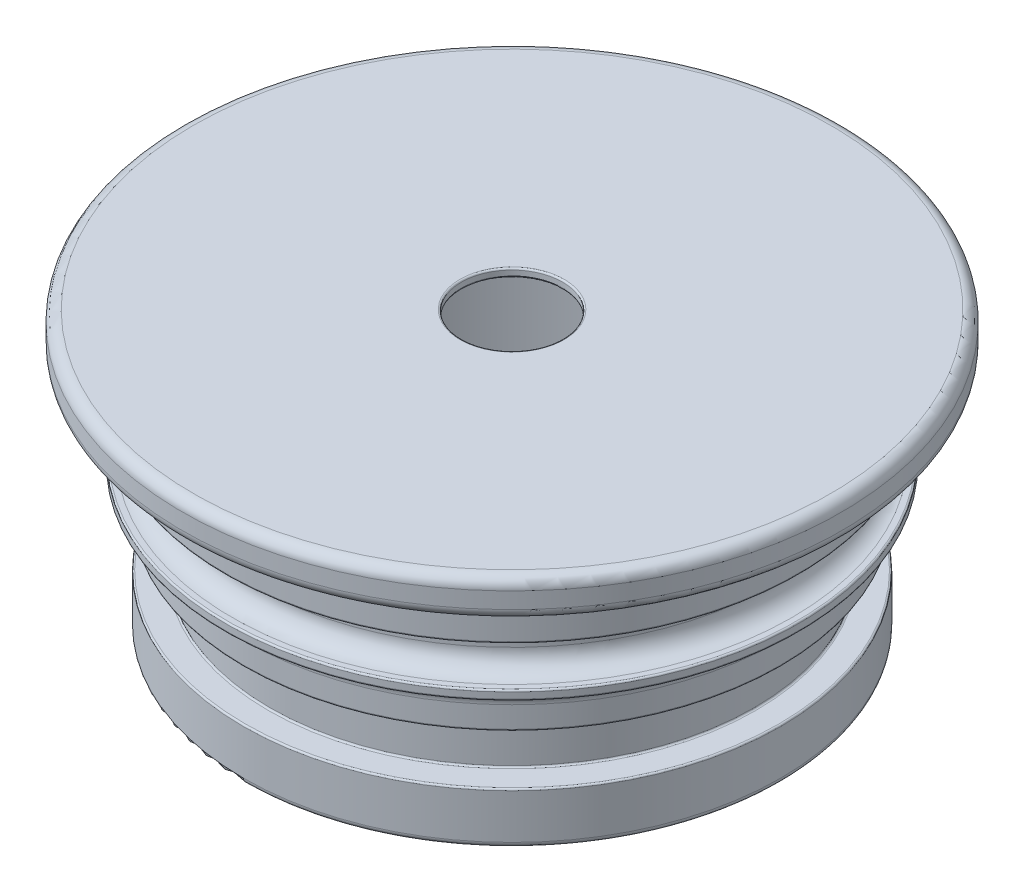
ISO-10303-21;
HEADER;
FILE_DESCRIPTION(('STEP AP214'),'2;1');
FILE_NAME('part.step','',(''),(''),'','','');
FILE_SCHEMA(('AUTOMOTIVE_DESIGN { 1 0 10303 214 1 1 1 1 }'));
ENDSEC;
DATA;
#1=APPLICATION_CONTEXT('core data for automotive mechanical design processes');
#2=APPLICATION_PROTOCOL_DEFINITION('international standard','automotive_design',2000,#1);
#3=PRODUCT_CONTEXT('',#1,'mechanical');
#4=PRODUCT('Part','Part','',(#3));
#5=PRODUCT_RELATED_PRODUCT_CATEGORY('part','',(#4));
#6=PRODUCT_DEFINITION_FORMATION('','',#4);
#7=PRODUCT_DEFINITION_CONTEXT('part definition',#1,'design');
#8=PRODUCT_DEFINITION('design','',#6,#7);
#9=PRODUCT_DEFINITION_SHAPE('','',#8);
#10=(LENGTH_UNIT() NAMED_UNIT(*) SI_UNIT(.MILLI.,.METRE.));
#11=(NAMED_UNIT(*) PLANE_ANGLE_UNIT() SI_UNIT($,.RADIAN.));
#12=(NAMED_UNIT(*) SI_UNIT($,.STERADIAN.) SOLID_ANGLE_UNIT());
#13=UNCERTAINTY_MEASURE_WITH_UNIT(LENGTH_MEASURE(1.E-05),#10,'distance_accuracy_value','');
#14=(GEOMETRIC_REPRESENTATION_CONTEXT(3) GLOBAL_UNCERTAINTY_ASSIGNED_CONTEXT((#13)) GLOBAL_UNIT_ASSIGNED_CONTEXT((#10,
#11,#12)) REPRESENTATION_CONTEXT('',''));
#15=CARTESIAN_POINT('',(0.,0.,0.));
#16=DIRECTION('',(0.,0.,1.));
#17=DIRECTION('',(1.,0.,0.));
#18=AXIS2_PLACEMENT_3D('',#15,#16,#17);
#19=CARTESIAN_POINT('',(0.,-5.1054,0.));
#20=DIRECTION('',(0.,1.,0.));
#21=DIRECTION('',(-1.00000000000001,0.,0.));
#22=AXIS2_PLACEMENT_3D('',#19,#20,#21);
#23=TOROIDAL_SURFACE('',#22,13.208,0.889);
#24=CARTESIAN_POINT('',(0.,-5.9944,0.));
#25=DIRECTION('',(0.,1.,0.));
#26=DIRECTION('',(-1.00000000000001,0.,0.));
#27=AXIS2_PLACEMENT_3D('',#24,#25,#26);
#28=CIRCLE('',#27,13.208);
#29=CARTESIAN_POINT('',(-13.2080000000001,-5.9944,0.));
#30=VERTEX_POINT('',#29);
#31=EDGE_CURVE('E142',#30,#30,#28,.T.);
#32=ORIENTED_EDGE('',*,*,#31,.T.);
#33=EDGE_LOOP('',(#32));
#34=FACE_BOUND('',#33,.T.);
#35=CARTESIAN_POINT('',(0.,-5.1054,0.));
#36=DIRECTION('',(0.,1.,0.));
#37=DIRECTION('',(-1.00000000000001,0.,0.));
#38=AXIS2_PLACEMENT_3D('',#35,#36,#37);
#39=CIRCLE('',#38,12.319);
#40=CARTESIAN_POINT('',(-12.3190000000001,-5.1054,0.));
#41=VERTEX_POINT('',#40);
#42=EDGE_CURVE('E10',#41,#41,#39,.T.);
#43=ORIENTED_EDGE('',*,*,#42,.F.);
#44=EDGE_LOOP('',(#43));
#45=FACE_BOUND('',#44,.T.);
#46=ADVANCED_FACE('F30',(#34,#45),#23,.F.);
#47=CARTESIAN_POINT('',(0.,0.,0.));
#48=DIRECTION('',(0.,1.,0.));
#49=DIRECTION('',(-1.00000000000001,0.,0.));
#50=AXIS2_PLACEMENT_3D('',#47,#48,#49);
#51=CYLINDRICAL_SURFACE('',#50,12.319);
#52=ORIENTED_EDGE('',*,*,#42,.T.);
#53=EDGE_LOOP('',(#52));
#54=FACE_BOUND('',#53,.T.);
#55=CARTESIAN_POINT('',(0.,-4.1656,0.));
#56=DIRECTION('',(0.,1.,0.));
#57=DIRECTION('',(-1.00000000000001,0.,0.));
#58=AXIS2_PLACEMENT_3D('',#55,#56,#57);
#59=CIRCLE('',#58,12.319);
#60=CARTESIAN_POINT('',(-12.3190000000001,-4.16560000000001,0.));
#61=VERTEX_POINT('',#60);
#62=EDGE_CURVE('E36',#61,#61,#59,.T.);
#63=ORIENTED_EDGE('',*,*,#62,.F.);
#64=EDGE_LOOP('',(#63));
#65=FACE_BOUND('',#64,.T.);
#66=ADVANCED_FACE('F160',(#54,#65),#51,.T.);
#67=CARTESIAN_POINT('',(0.,-4.1656,0.));
#68=DIRECTION('',(0.,1.,0.));
#69=DIRECTION('',(-1.00000000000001,0.,0.));
#70=AXIS2_PLACEMENT_3D('',#67,#68,#69);
#71=TOROIDAL_SURFACE('',#70,12.3952,0.0762000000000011);
#72=ORIENTED_EDGE('',*,*,#62,.T.);
#73=EDGE_LOOP('',(#72));
#74=FACE_BOUND('',#73,.T.);
#75=CARTESIAN_POINT('',(0.,-4.0894,0.));
#76=DIRECTION('',(0.,1.,0.));
#77=DIRECTION('',(-1.00000000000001,0.,0.));
#78=AXIS2_PLACEMENT_3D('',#75,#76,#77);
#79=CIRCLE('',#78,12.3952);
#80=CARTESIAN_POINT('',(-12.3952000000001,-4.0894,0.));
#81=VERTEX_POINT('',#80);
#82=EDGE_CURVE('E40',#81,#81,#79,.T.);
#83=ORIENTED_EDGE('',*,*,#82,.F.);
#84=EDGE_LOOP('',(#83));
#85=FACE_BOUND('',#84,.T.);
#86=ADVANCED_FACE('F164',(#74,#85),#71,.F.);
#87=CARTESIAN_POINT('',(-12.3952000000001,-4.0894,0.));
#88=DIRECTION('',(0.,-1.,0.));
#89=DIRECTION('',(1.00000000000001,0.,0.));
#90=AXIS2_PLACEMENT_3D('',#87,#88,#89);
#91=PLANE('',#90);
#92=ORIENTED_EDGE('',*,*,#82,.T.);
#93=EDGE_LOOP('',(#92));
#94=FACE_BOUND('',#93,.T.);
#95=CARTESIAN_POINT('',(0.,-4.0894,0.));
#96=DIRECTION('',(0.,1.,0.));
#97=DIRECTION('',(-1.00000000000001,0.,0.));
#98=AXIS2_PLACEMENT_3D('',#95,#96,#97);
#99=CIRCLE('',#98,13.462);
#100=CARTESIAN_POINT('',(-13.4620000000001,-4.0894,0.));
#101=VERTEX_POINT('',#100);
#102=EDGE_CURVE('E44',#101,#101,#99,.T.);
#103=ORIENTED_EDGE('',*,*,#102,.F.);
#104=EDGE_LOOP('',(#103));
#105=FACE_BOUND('',#104,.T.);
#106=ADVANCED_FACE('F168',(#94,#105),#91,.T.);
#107=CARTESIAN_POINT('',(0.,-4.0132,0.));
#108=DIRECTION('',(0.,1.,0.));
#109=DIRECTION('',(-1.00000000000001,0.,0.));
#110=AXIS2_PLACEMENT_3D('',#107,#108,#109);
#111=TOROIDAL_SURFACE('',#110,13.462,0.0762000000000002);
#112=ORIENTED_EDGE('',*,*,#102,.T.);
#113=EDGE_LOOP('',(#112));
#114=FACE_BOUND('',#113,.T.);
#115=CARTESIAN_POINT('',(0.,-4.0132,0.));
#116=DIRECTION('',(0.,1.,0.));
#117=DIRECTION('',(-1.00000000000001,0.,0.));
#118=AXIS2_PLACEMENT_3D('',#115,#116,#117);
#119=CIRCLE('',#118,13.5382);
#120=CARTESIAN_POINT('',(-13.5382000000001,-4.0132,0.));
#121=VERTEX_POINT('',#120);
#122=EDGE_CURVE('E49',#121,#121,#119,.T.);
#123=ORIENTED_EDGE('',*,*,#122,.F.);
#124=EDGE_LOOP('',(#123));
#125=FACE_BOUND('',#124,.T.);
#126=ADVANCED_FACE('F174',(#114,#125),#111,.T.);
#127=CARTESIAN_POINT('',(0.,0.,0.));
#128=DIRECTION('',(0.,1.,0.));
#129=DIRECTION('',(-1.00000000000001,0.,0.));
#130=AXIS2_PLACEMENT_3D('',#127,#128,#129);
#131=CYLINDRICAL_SURFACE('',#130,13.5382);
#132=ORIENTED_EDGE('',*,*,#122,.T.);
#133=EDGE_LOOP('',(#132));
#134=FACE_BOUND('',#133,.T.);
#135=CARTESIAN_POINT('',(0.,-1.8542,0.));
#136=DIRECTION('',(0.,1.,0.));
#137=DIRECTION('',(-1.00000000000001,0.,0.));
#138=AXIS2_PLACEMENT_3D('',#135,#136,#137);
#139=CIRCLE('',#138,13.5382);
#140=CARTESIAN_POINT('',(-13.5382000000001,-1.8542,0.));
#141=VERTEX_POINT('',#140);
#142=EDGE_CURVE('E52',#141,#141,#139,.T.);
#143=ORIENTED_EDGE('',*,*,#142,.F.);
#144=EDGE_LOOP('',(#143));
#145=FACE_BOUND('',#144,.T.);
#146=ADVANCED_FACE('F178',(#134,#145),#131,.T.);
#147=CARTESIAN_POINT('',(0.,-1.8542,0.));
#148=DIRECTION('',(0.,1.,0.));
#149=DIRECTION('',(-1.00000000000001,0.,0.));
#150=AXIS2_PLACEMENT_3D('',#147,#148,#149);
#151=TOROIDAL_SURFACE('',#150,13.6144,0.0762000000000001);
#152=ORIENTED_EDGE('',*,*,#142,.T.);
#153=EDGE_LOOP('',(#152));
#154=FACE_BOUND('',#153,.T.);
#155=CARTESIAN_POINT('',(0.,-1.778,0.));
#156=DIRECTION('',(0.,1.,0.));
#157=DIRECTION('',(-1.00000000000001,0.,0.));
#158=AXIS2_PLACEMENT_3D('',#155,#156,#157);
#159=CIRCLE('',#158,13.6144);
#160=CARTESIAN_POINT('',(-13.6144000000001,-1.778,0.));
#161=VERTEX_POINT('',#160);
#162=EDGE_CURVE('E55',#161,#161,#159,.T.);
#163=ORIENTED_EDGE('',*,*,#162,.F.);
#164=EDGE_LOOP('',(#163));
#165=FACE_BOUND('',#164,.T.);
#166=ADVANCED_FACE('F182',(#154,#165),#151,.F.);
#167=CARTESIAN_POINT('',(-15.0495000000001,-1.778,0.));
#168=DIRECTION('',(0.,-1.,0.));
#169=DIRECTION('',(1.00000000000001,0.,0.));
#170=AXIS2_PLACEMENT_3D('',#167,#168,#169);
#171=PLANE('',#170);
#172=ORIENTED_EDGE('',*,*,#162,.T.);
#173=EDGE_LOOP('',(#172));
#174=FACE_BOUND('',#173,.T.);
#175=CARTESIAN_POINT('',(0.,-1.778,0.));
#176=DIRECTION('',(0.,1.,0.));
#177=DIRECTION('',(-1.00000000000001,0.,0.));
#178=AXIS2_PLACEMENT_3D('',#175,#176,#177);
#179=CIRCLE('',#178,15.0495);
#180=CARTESIAN_POINT('',(-15.0495000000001,-1.778,0.));
#181=VERTEX_POINT('',#180);
#182=EDGE_CURVE('E58',#181,#181,#179,.T.);
#183=ORIENTED_EDGE('',*,*,#182,.F.);
#184=EDGE_LOOP('',(#183));
#185=FACE_BOUND('',#184,.T.);
#186=ADVANCED_FACE('F186',(#174,#185),#171,.T.);
#187=CARTESIAN_POINT('',(0.,-1.27,0.));
#188=DIRECTION('',(0.,1.,0.));
#189=DIRECTION('',(-1.00000000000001,0.,0.));
#190=AXIS2_PLACEMENT_3D('',#187,#188,#189);
#191=TOROIDAL_SURFACE('',#190,15.0495,0.507999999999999);
#192=ORIENTED_EDGE('',*,*,#182,.T.);
#193=EDGE_LOOP('',(#192));
#194=FACE_BOUND('',#193,.T.);
#195=CARTESIAN_POINT('',(0.,-1.27,0.));
#196=DIRECTION('',(0.,1.,0.));
#197=DIRECTION('',(-1.00000000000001,0.,0.));
#198=AXIS2_PLACEMENT_3D('',#195,#196,#197);
#199=CIRCLE('',#198,15.5575);
#200=CARTESIAN_POINT('',(-15.5575000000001,-1.27,0.));
#201=VERTEX_POINT('',#200);
#202=EDGE_CURVE('E61',#201,#201,#199,.T.);
#203=ORIENTED_EDGE('',*,*,#202,.F.);
#204=EDGE_LOOP('',(#203));
#205=FACE_BOUND('',#204,.T.);
#206=ADVANCED_FACE('F190',(#194,#205),#191,.T.);
#207=CARTESIAN_POINT('',(0.,0.,0.));
#208=DIRECTION('',(0.,1.,0.));
#209=DIRECTION('',(-1.00000000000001,0.,0.));
#210=AXIS2_PLACEMENT_3D('',#207,#208,#209);
#211=CYLINDRICAL_SURFACE('',#210,15.5575);
#212=ORIENTED_EDGE('',*,*,#202,.T.);
#213=EDGE_LOOP('',(#212));
#214=FACE_BOUND('',#213,.T.);
#215=CARTESIAN_POINT('',(0.,-0.507999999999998,0.));
#216=DIRECTION('',(0.,1.,0.));
#217=DIRECTION('',(-1.00000000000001,0.,0.));
#218=AXIS2_PLACEMENT_3D('',#215,#216,#217);
#219=CIRCLE('',#218,15.5575);
#220=CARTESIAN_POINT('',(-15.5575000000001,-0.508,0.));
#221=VERTEX_POINT('',#220);
#222=EDGE_CURVE('E64',#221,#221,#219,.T.);
#223=ORIENTED_EDGE('',*,*,#222,.F.);
#224=EDGE_LOOP('',(#223));
#225=FACE_BOUND('',#224,.T.);
#226=ADVANCED_FACE('F194',(#214,#225),#211,.T.);
#227=CARTESIAN_POINT('',(0.,-0.508000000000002,0.));
#228=DIRECTION('',(0.,1.,0.));
#229=DIRECTION('',(-1.00000000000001,0.,0.));
#230=AXIS2_PLACEMENT_3D('',#227,#228,#229);
#231=TOROIDAL_SURFACE('',#230,15.0495,0.508);
#232=ORIENTED_EDGE('',*,*,#222,.T.);
#233=EDGE_LOOP('',(#232));
#234=FACE_BOUND('',#233,.T.);
#235=CARTESIAN_POINT('',(0.,0.,0.));
#236=DIRECTION('',(0.,1.,0.));
#237=DIRECTION('',(-1.00000000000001,0.,0.));
#238=AXIS2_PLACEMENT_3D('',#235,#236,#237);
#239=CIRCLE('',#238,15.0495);
#240=CARTESIAN_POINT('',(-15.0495000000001,0.,0.));
#241=VERTEX_POINT('',#240);
#242=EDGE_CURVE('E67',#241,#241,#239,.T.);
#243=ORIENTED_EDGE('',*,*,#242,.F.);
#244=EDGE_LOOP('',(#243));
#245=FACE_BOUND('',#244,.T.);
#246=ADVANCED_FACE('F198',(#234,#245),#231,.T.);
#247=CARTESIAN_POINT('',(-2.46380000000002,0.,0.));
#248=DIRECTION('',(0.,1.,0.));
#249=DIRECTION('',(-1.00000000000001,0.,0.));
#250=AXIS2_PLACEMENT_3D('',#247,#248,#249);
#251=PLANE('',#250);
#252=ORIENTED_EDGE('',*,*,#242,.T.);
#253=EDGE_LOOP('',(#252));
#254=FACE_BOUND('',#253,.T.);
#255=CARTESIAN_POINT('',(0.,0.,0.));
#256=DIRECTION('',(0.,1.,0.));
#257=DIRECTION('',(-1.00000000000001,0.,0.));
#258=AXIS2_PLACEMENT_3D('',#255,#256,#257);
#259=CIRCLE('',#258,2.4638);
#260=CARTESIAN_POINT('',(-2.46380000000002,0.,0.));
#261=VERTEX_POINT('',#260);
#262=EDGE_CURVE('E70',#261,#261,#259,.T.);
#263=ORIENTED_EDGE('',*,*,#262,.F.);
#264=EDGE_LOOP('',(#263));
#265=FACE_BOUND('',#264,.T.);
#266=ADVANCED_FACE('F202',(#254,#265),#251,.T.);
#267=CARTESIAN_POINT('',(0.,-0.0761999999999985,0.));
#268=DIRECTION('',(0.,1.,0.));
#269=DIRECTION('',(-1.00000000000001,0.,0.));
#270=AXIS2_PLACEMENT_3D('',#267,#268,#269);
#271=TOROIDAL_SURFACE('',#270,2.4638,0.0762);
#272=ORIENTED_EDGE('',*,*,#262,.T.);
#273=EDGE_LOOP('',(#272));
#274=FACE_BOUND('',#273,.T.);
#275=CARTESIAN_POINT('',(0.,-0.0761999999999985,0.));
#276=DIRECTION('',(0.,1.,0.));
#277=DIRECTION('',(-1.00000000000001,0.,0.));
#278=AXIS2_PLACEMENT_3D('',#275,#276,#277);
#279=CIRCLE('',#278,2.3876);
#280=CARTESIAN_POINT('',(-2.38760000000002,-0.0761999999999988,0.));
#281=VERTEX_POINT('',#280);
#282=EDGE_CURVE('E73',#281,#281,#279,.T.);
#283=ORIENTED_EDGE('',*,*,#282,.F.);
#284=EDGE_LOOP('',(#283));
#285=FACE_BOUND('',#284,.T.);
#286=ADVANCED_FACE('F206',(#274,#285),#271,.T.);
#287=CARTESIAN_POINT('',(0.,0.,0.));
#288=DIRECTION('',(0.,1.,0.));
#289=DIRECTION('',(-1.00000000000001,0.,0.));
#290=AXIS2_PLACEMENT_3D('',#287,#288,#289);
#291=CYLINDRICAL_SURFACE('',#290,2.3876);
#292=ORIENTED_EDGE('',*,*,#282,.T.);
#293=EDGE_LOOP('',(#292));
#294=FACE_BOUND('',#293,.T.);
#295=CARTESIAN_POINT('',(0.,-0.31706060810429,0.));
#296=DIRECTION('',(0.,1.,0.));
#297=DIRECTION('',(-1.00000000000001,0.,0.));
#298=AXIS2_PLACEMENT_3D('',#295,#296,#297);
#299=CIRCLE('',#298,2.3876);
#300=CARTESIAN_POINT('',(-2.38760000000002,-0.31706060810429,0.));
#301=VERTEX_POINT('',#300);
#302=EDGE_CURVE('E76',#301,#301,#299,.T.);
#303=ORIENTED_EDGE('',*,*,#302,.F.);
#304=EDGE_LOOP('',(#303));
#305=FACE_BOUND('',#304,.T.);
#306=ADVANCED_FACE('F210',(#294,#305),#291,.F.);
#307=CARTESIAN_POINT('',(0.,-0.31706060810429,0.));
#308=DIRECTION('',(0.,1.,0.));
#309=DIRECTION('',(-1.00000000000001,0.,0.));
#310=AXIS2_PLACEMENT_3D('',#307,#308,#309);
#311=TOROIDAL_SURFACE('',#310,2.4638,0.0761999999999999);
#312=ORIENTED_EDGE('',*,*,#302,.T.);
#313=EDGE_LOOP('',(#312));
#314=FACE_BOUND('',#313,.T.);
#315=CARTESIAN_POINT('',(0.,-0.392102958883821,0.));
#316=DIRECTION('',(0.,1.,0.));
#317=DIRECTION('',(-1.00000000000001,0.,0.));
#318=AXIS2_PLACEMENT_3D('',#315,#316,#317);
#319=CIRCLE('',#318,2.45056800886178);
#320=CARTESIAN_POINT('',(2.45056800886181,-0.392102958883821,0.));
#321=VERTEX_POINT('',#320);
#322=EDGE_CURVE('E79',#321,#321,#319,.T.);
#323=ORIENTED_EDGE('',*,*,#322,.F.);
#324=EDGE_LOOP('',(#323));
#325=FACE_BOUND('',#324,.T.);
#326=ADVANCED_FACE('F214',(#314,#325),#311,.T.);
#327=CARTESIAN_POINT('',(0.,-1.63361508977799,0.));
#328=DIRECTION('',(0.,-1.,0.));
#329=DIRECTION('',(1.00000000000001,0.,0.));
#330=AXIS2_PLACEMENT_3D('',#327,#328,#329);
#331=CONICAL_SURFACE('',#330,9.49153318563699,1.39626340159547);
#332=CARTESIAN_POINT('',(0.,-1.63361508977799,0.));
#333=DIRECTION('',(0.,1.,0.));
#334=DIRECTION('',(-1.00000000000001,0.,0.));
#335=AXIS2_PLACEMENT_3D('',#332,#333,#334);
#336=CIRCLE('',#335,9.49153318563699);
#337=CARTESIAN_POINT('',(9.49153318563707,-1.63361508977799,0.));
#338=VERTEX_POINT('',#337);
#339=EDGE_CURVE('E82',#338,#338,#336,.T.);
#340=CARTESIAN_POINT('',(2.45056800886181,-0.392102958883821,0.));
#341=CARTESIAN_POINT('',(2.52391139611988,-0.405035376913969,0.));
#342=CARTESIAN_POINT('',(2.59725478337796,-0.417967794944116,0.));
#343=CARTESIAN_POINT('',(2.74394155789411,-0.443832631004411,0.));
#344=CARTESIAN_POINT('',(2.81728494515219,-0.456765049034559,0.));
#345=CARTESIAN_POINT('',(2.96397171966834,-0.482629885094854,0.));
#346=CARTESIAN_POINT('',(3.03731510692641,-0.495562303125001,0.));
#347=CARTESIAN_POINT('',(3.18400188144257,-0.521427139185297,0.));
#348=CARTESIAN_POINT('',(3.25734526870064,-0.534359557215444,0.));
#349=CARTESIAN_POINT('',(3.40403204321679,-0.560224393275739,0.));
#350=CARTESIAN_POINT('',(3.47737543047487,-0.573156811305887,0.));
#351=CARTESIAN_POINT('',(3.62406220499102,-0.599021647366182,0.));
#352=CARTESIAN_POINT('',(3.69740559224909,-0.61195406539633,0.));
#353=CARTESIAN_POINT('',(3.84409236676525,-0.637818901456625,0.));
#354=CARTESIAN_POINT('',(3.91743575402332,-0.650751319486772,0.));
#355=CARTESIAN_POINT('',(4.06412252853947,-0.676616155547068,0.));
#356=CARTESIAN_POINT('',(4.13746591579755,-0.689548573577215,0.));
#357=CARTESIAN_POINT('',(4.2841526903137,-0.71541340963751,0.));
#358=CARTESIAN_POINT('',(4.35749607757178,-0.728345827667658,0.));
#359=CARTESIAN_POINT('',(4.50418285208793,-0.754210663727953,0.));
#360=CARTESIAN_POINT('',(4.577526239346,-0.7671430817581,0.));
#361=CARTESIAN_POINT('',(4.72421301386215,-0.793007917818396,0.));
#362=CARTESIAN_POINT('',(4.79755640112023,-0.805940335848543,0.));
#363=CARTESIAN_POINT('',(4.94424317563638,-0.831805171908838,0.));
#364=CARTESIAN_POINT('',(5.01758656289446,-0.844737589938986,0.));
#365=CARTESIAN_POINT('',(5.16427333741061,-0.870602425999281,0.));
#366=CARTESIAN_POINT('',(5.23761672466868,-0.883534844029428,0.));
#367=CARTESIAN_POINT('',(5.38430349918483,-0.909399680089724,0.));
#368=CARTESIAN_POINT('',(5.45764688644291,-0.922332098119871,0.));
#369=CARTESIAN_POINT('',(5.60433366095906,-0.948196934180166,0.));
#370=CARTESIAN_POINT('',(5.67767704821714,-0.961129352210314,0.));
#371=CARTESIAN_POINT('',(5.82436382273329,-0.986994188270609,0.));
#372=CARTESIAN_POINT('',(5.89770720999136,-0.999926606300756,0.));
#373=CARTESIAN_POINT('',(6.04439398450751,-1.02579144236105,0.));
#374=CARTESIAN_POINT('',(6.11773737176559,-1.0387238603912,0.));
#375=CARTESIAN_POINT('',(6.26442414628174,-1.06458869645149,0.));
#376=CARTESIAN_POINT('',(6.33776753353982,-1.07752111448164,0.));
#377=CARTESIAN_POINT('',(6.48445430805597,-1.10338595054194,0.));
#378=CARTESIAN_POINT('',(6.55779769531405,-1.11631836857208,0.));
#379=CARTESIAN_POINT('',(6.7044844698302,-1.14218320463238,0.));
#380=CARTESIAN_POINT('',(6.77782785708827,-1.15511562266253,0.));
#381=CARTESIAN_POINT('',(6.92451463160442,-1.18098045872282,0.));
#382=CARTESIAN_POINT('',(6.9978580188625,-1.19391287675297,0.));
#383=CARTESIAN_POINT('',(7.14454479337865,-1.21977771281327,0.));
#384=CARTESIAN_POINT('',(7.21788818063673,-1.23271013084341,0.));
#385=CARTESIAN_POINT('',(7.36457495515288,-1.25857496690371,0.));
#386=CARTESIAN_POINT('',(7.43791834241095,-1.27150738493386,0.));
#387=CARTESIAN_POINT('',(7.5846051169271,-1.29737222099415,0.));
#388=CARTESIAN_POINT('',(7.65794850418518,-1.3103046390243,0.));
#389=CARTESIAN_POINT('',(7.80463527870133,-1.33616947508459,0.));
#390=CARTESIAN_POINT('',(7.87797866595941,-1.34910189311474,0.));
#391=CARTESIAN_POINT('',(8.02466544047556,-1.37496672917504,0.));
#392=CARTESIAN_POINT('',(8.09800882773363,-1.38789914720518,0.));
#393=CARTESIAN_POINT('',(8.24469560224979,-1.41376398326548,0.));
#394=CARTESIAN_POINT('',(8.31803898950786,-1.42669640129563,0.));
#395=CARTESIAN_POINT('',(8.46472576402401,-1.45256123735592,0.));
#396=CARTESIAN_POINT('',(8.53806915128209,-1.46549365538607,0.));
#397=CARTESIAN_POINT('',(8.68475592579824,-1.49135849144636,0.));
#398=CARTESIAN_POINT('',(8.75809931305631,-1.50429090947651,0.));
#399=CARTESIAN_POINT('',(8.90478608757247,-1.53015574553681,0.));
#400=CARTESIAN_POINT('',(8.97812947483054,-1.54308816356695,0.));
#401=CARTESIAN_POINT('',(9.12481624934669,-1.56895299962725,0.));
#402=CARTESIAN_POINT('',(9.19815963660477,-1.5818854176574,0.));
#403=CARTESIAN_POINT('',(9.34484641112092,-1.60775025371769,0.));
#404=CARTESIAN_POINT('',(9.41818979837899,-1.62068267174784,0.));
#405=CARTESIAN_POINT('',(9.49153318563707,-1.63361508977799,0.));
#406=B_SPLINE_CURVE_WITH_KNOTS('',3,(#340,#341,#342,#343,#344,#345,#346,#347,#348,#349,#350,
#351,#352,#353,#354,#355,#356,#357,#358,#359,#360,#361,#362,#363,#364,#365,#366,#367,#368,#369,
#370,#371,#372,#373,#374,#375,#376,#377,#378,#379,#380,#381,#382,#383,#384,#385,#386,#387,#388,
#389,#390,#391,#392,#393,#394,#395,#396,#397,#398,#399,#400,#401,#402,#403,#404,#405),
.UNSPECIFIED.,.F.,.F.,(4,2,2,2,2,2,2,2,2,2,2,2,2,2,2,2,2,2,2,2,2,2,2,2,2,2,2,2,2,2,2,2,4),(0.,
0.223424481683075,0.44684896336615,0.670273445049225,0.893697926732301,1.11712240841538,
1.34054689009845,1.56397137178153,1.7873958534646,2.01082033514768,2.23424481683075,
2.45766929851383,2.6810937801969,2.90451826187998,3.12794274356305,3.35136722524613,
3.5747917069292,3.79821618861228,4.02164067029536,4.24506515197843,4.46848963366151,
4.69191411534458,4.91533859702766,5.13876307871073,5.3621875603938,5.58561204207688,
5.80903652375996,6.03246100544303,6.2558854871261,6.47930996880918,6.70273445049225,
6.92615893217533,7.1495834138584),.UNSPECIFIED.);
#407=EDGE_CURVE('BSEAM218',#321,#338,#406,.T.);
#408=ORIENTED_EDGE('',*,*,#322,.T.);
#409=ORIENTED_EDGE('',*,*,#339,.F.);
#410=ORIENTED_EDGE('',*,*,#407,.T.);
#411=ORIENTED_EDGE('',*,*,#407,.F.);
#412=EDGE_LOOP('',(#408,#410,#409,#411));
#413=FACE_BOUND('',#412,.T.);
#414=ADVANCED_FACE('F218',(#413),#331,.F.);
#415=CARTESIAN_POINT('',(0.,-2.88432093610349,0.));
#416=DIRECTION('',(0.,1.,0.));
#417=DIRECTION('',(-1.00000000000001,0.,0.));
#418=AXIS2_PLACEMENT_3D('',#415,#416,#417);
#419=TOROIDAL_SURFACE('',#418,9.271,1.27);
#420=ORIENTED_EDGE('',*,*,#339,.T.);
#421=EDGE_LOOP('',(#420));
#422=FACE_BOUND('',#421,.T.);
#423=CARTESIAN_POINT('',(0.,-2.88432093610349,0.));
#424=DIRECTION('',(0.,1.,0.));
#425=DIRECTION('',(-1.00000000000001,0.,0.));
#426=AXIS2_PLACEMENT_3D('',#423,#424,#425);
#427=CIRCLE('',#426,10.541);
#428=CARTESIAN_POINT('',(-10.5410000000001,-2.8843209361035,0.));
#429=VERTEX_POINT('',#428);
#430=EDGE_CURVE('E85',#429,#429,#427,.T.);
#431=ORIENTED_EDGE('',*,*,#430,.F.);
#432=EDGE_LOOP('',(#431));
#433=FACE_BOUND('',#432,.T.);
#434=ADVANCED_FACE('F222',(#422,#433),#419,.F.);
#435=CARTESIAN_POINT('',(0.,0.,0.));
#436=DIRECTION('',(0.,1.,0.));
#437=DIRECTION('',(-1.00000000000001,0.,0.));
#438=AXIS2_PLACEMENT_3D('',#435,#436,#437);
#439=CYLINDRICAL_SURFACE('',#438,10.541);
#440=ORIENTED_EDGE('',*,*,#430,.T.);
#441=EDGE_LOOP('',(#440));
#442=FACE_BOUND('',#441,.T.);
#443=CARTESIAN_POINT('',(0.,-13.0048,0.));
#444=DIRECTION('',(0.,1.,0.));
#445=DIRECTION('',(-1.00000000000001,0.,0.));
#446=AXIS2_PLACEMENT_3D('',#443,#444,#445);
#447=CIRCLE('',#446,10.541);
#448=CARTESIAN_POINT('',(-10.5410000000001,-13.0048,0.));
#449=VERTEX_POINT('',#448);
#450=EDGE_CURVE('E88',#449,#449,#447,.T.);
#451=ORIENTED_EDGE('',*,*,#450,.F.);
#452=EDGE_LOOP('',(#451));
#453=FACE_BOUND('',#452,.T.);
#454=ADVANCED_FACE('F226',(#442,#453),#439,.F.);
#455=CARTESIAN_POINT('',(0.,-13.0048,0.));
#456=DIRECTION('',(0.,1.,0.));
#457=DIRECTION('',(-1.00000000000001,0.,0.));
#458=AXIS2_PLACEMENT_3D('',#455,#456,#457);
#459=TOROIDAL_SURFACE('',#458,10.6172,0.0762000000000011);
#460=ORIENTED_EDGE('',*,*,#450,.T.);
#461=EDGE_LOOP('',(#460));
#462=FACE_BOUND('',#461,.T.);
#463=CARTESIAN_POINT('',(0.,-13.081,0.));
#464=DIRECTION('',(0.,1.,0.));
#465=DIRECTION('',(-1.00000000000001,0.,0.));
#466=AXIS2_PLACEMENT_3D('',#463,#464,#465);
#467=CIRCLE('',#466,10.6172);
#468=CARTESIAN_POINT('',(-10.6172000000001,-13.081,0.));
#469=VERTEX_POINT('',#468);
#470=EDGE_CURVE('E91',#469,#469,#467,.T.);
#471=ORIENTED_EDGE('',*,*,#470,.F.);
#472=EDGE_LOOP('',(#471));
#473=FACE_BOUND('',#472,.T.);
#474=ADVANCED_FACE('F230',(#462,#473),#459,.T.);
#475=CARTESIAN_POINT('',(-12.4206000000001,-13.081,0.));
#476=DIRECTION('',(0.,-1.,0.));
#477=DIRECTION('',(1.00000000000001,0.,0.));
#478=AXIS2_PLACEMENT_3D('',#475,#476,#477);
#479=PLANE('',#478);
#480=ORIENTED_EDGE('',*,*,#470,.T.);
#481=EDGE_LOOP('',(#480));
#482=FACE_BOUND('',#481,.T.);
#483=CARTESIAN_POINT('',(0.,-13.081,0.));
#484=DIRECTION('',(0.,1.,0.));
#485=DIRECTION('',(-1.00000000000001,0.,0.));
#486=AXIS2_PLACEMENT_3D('',#483,#484,#485);
#487=CIRCLE('',#486,12.4206);
#488=CARTESIAN_POINT('',(-12.4206000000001,-13.081,0.));
#489=VERTEX_POINT('',#488);
#490=EDGE_CURVE('E94',#489,#489,#487,.T.);
#491=ORIENTED_EDGE('',*,*,#490,.F.);
#492=EDGE_LOOP('',(#491));
#493=FACE_BOUND('',#492,.T.);
#494=ADVANCED_FACE('F234',(#482,#493),#479,.T.);
#495=CARTESIAN_POINT('',(0.,-12.827,0.));
#496=DIRECTION('',(0.,1.,0.));
#497=DIRECTION('',(-1.00000000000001,0.,0.));
#498=AXIS2_PLACEMENT_3D('',#495,#496,#497);
#499=TOROIDAL_SURFACE('',#498,12.4206,0.254000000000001);
#500=ORIENTED_EDGE('',*,*,#490,.T.);
#501=EDGE_LOOP('',(#500));
#502=FACE_BOUND('',#501,.T.);
#503=CARTESIAN_POINT('',(0.,-12.827,0.));
#504=DIRECTION('',(0.,1.,0.));
#505=DIRECTION('',(-1.00000000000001,0.,0.));
#506=AXIS2_PLACEMENT_3D('',#503,#504,#505);
#507=CIRCLE('',#506,12.6746);
#508=CARTESIAN_POINT('',(-12.6746000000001,-12.827,0.));
#509=VERTEX_POINT('',#508);
#510=EDGE_CURVE('E97',#509,#509,#507,.T.);
#511=ORIENTED_EDGE('',*,*,#510,.F.);
#512=EDGE_LOOP('',(#511));
#513=FACE_BOUND('',#512,.T.);
#514=ADVANCED_FACE('F238',(#502,#513),#499,.T.);
#515=CARTESIAN_POINT('',(0.,0.,0.));
#516=DIRECTION('',(0.,1.,0.));
#517=DIRECTION('',(-1.00000000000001,0.,0.));
#518=AXIS2_PLACEMENT_3D('',#515,#516,#517);
#519=CYLINDRICAL_SURFACE('',#518,12.6746);
#520=ORIENTED_EDGE('',*,*,#510,.T.);
#521=EDGE_LOOP('',(#520));
#522=FACE_BOUND('',#521,.T.);
#523=CARTESIAN_POINT('',(0.,-10.7188,0.));
#524=DIRECTION('',(0.,1.,0.));
#525=DIRECTION('',(-1.00000000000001,0.,0.));
#526=AXIS2_PLACEMENT_3D('',#523,#524,#525);
#527=CIRCLE('',#526,12.6746);
#528=CARTESIAN_POINT('',(-12.6746000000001,-10.7188,0.));
#529=VERTEX_POINT('',#528);
#530=EDGE_CURVE('E100',#529,#529,#527,.T.);
#531=ORIENTED_EDGE('',*,*,#530,.F.);
#532=EDGE_LOOP('',(#531));
#533=FACE_BOUND('',#532,.T.);
#534=ADVANCED_FACE('F242',(#522,#533),#519,.T.);
#535=CARTESIAN_POINT('',(0.,-10.7188,0.));
#536=DIRECTION('',(0.,1.,0.));
#537=DIRECTION('',(-1.00000000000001,0.,0.));
#538=AXIS2_PLACEMENT_3D('',#535,#536,#537);
#539=TOROIDAL_SURFACE('',#538,12.5984,0.0762000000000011);
#540=ORIENTED_EDGE('',*,*,#530,.T.);
#541=EDGE_LOOP('',(#540));
#542=FACE_BOUND('',#541,.T.);
#543=CARTESIAN_POINT('',(0.,-10.6426,0.));
#544=DIRECTION('',(0.,1.,0.));
#545=DIRECTION('',(-1.00000000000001,0.,0.));
#546=AXIS2_PLACEMENT_3D('',#543,#544,#545);
#547=CIRCLE('',#546,12.5984);
#548=CARTESIAN_POINT('',(-12.5984000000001,-10.6426,0.));
#549=VERTEX_POINT('',#548);
#550=EDGE_CURVE('E103',#549,#549,#547,.T.);
#551=ORIENTED_EDGE('',*,*,#550,.F.);
#552=EDGE_LOOP('',(#551));
#553=FACE_BOUND('',#552,.T.);
#554=ADVANCED_FACE('F246',(#542,#553),#539,.T.);
#555=CARTESIAN_POINT('',(-11.5062000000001,-10.6426,0.));
#556=DIRECTION('',(0.,1.,0.));
#557=DIRECTION('',(-1.00000000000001,0.,0.));
#558=AXIS2_PLACEMENT_3D('',#555,#556,#557);
#559=PLANE('',#558);
#560=ORIENTED_EDGE('',*,*,#550,.T.);
#561=EDGE_LOOP('',(#560));
#562=FACE_BOUND('',#561,.T.);
#563=CARTESIAN_POINT('',(0.,-10.6426,0.));
#564=DIRECTION('',(0.,1.,0.));
#565=DIRECTION('',(-1.00000000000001,0.,0.));
#566=AXIS2_PLACEMENT_3D('',#563,#564,#565);
#567=CIRCLE('',#566,11.5062);
#568=CARTESIAN_POINT('',(-11.5062000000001,-10.6426,0.));
#569=VERTEX_POINT('',#568);
#570=EDGE_CURVE('E106',#569,#569,#567,.T.);
#571=ORIENTED_EDGE('',*,*,#570,.F.);
#572=EDGE_LOOP('',(#571));
#573=FACE_BOUND('',#572,.T.);
#574=ADVANCED_FACE('F250',(#562,#573),#559,.T.);
#575=CARTESIAN_POINT('',(0.,-10.5664,0.));
#576=DIRECTION('',(0.,1.,0.));
#577=DIRECTION('',(-1.00000000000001,0.,0.));
#578=AXIS2_PLACEMENT_3D('',#575,#576,#577);
#579=TOROIDAL_SURFACE('',#578,11.5062,0.0761999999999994);
#580=ORIENTED_EDGE('',*,*,#570,.T.);
#581=EDGE_LOOP('',(#580));
#582=FACE_BOUND('',#581,.T.);
#583=CARTESIAN_POINT('',(0.,-10.5664,0.));
#584=DIRECTION('',(0.,1.,0.));
#585=DIRECTION('',(-1.00000000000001,0.,0.));
#586=AXIS2_PLACEMENT_3D('',#583,#584,#585);
#587=CIRCLE('',#586,11.43);
#588=CARTESIAN_POINT('',(-11.4300000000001,-10.5664,0.));
#589=VERTEX_POINT('',#588);
#590=EDGE_CURVE('E109',#589,#589,#587,.T.);
#591=ORIENTED_EDGE('',*,*,#590,.F.);
#592=EDGE_LOOP('',(#591));
#593=FACE_BOUND('',#592,.T.);
#594=ADVANCED_FACE('F254',(#582,#593),#579,.F.);
#595=CARTESIAN_POINT('',(0.,0.,0.));
#596=DIRECTION('',(0.,1.,0.));
#597=DIRECTION('',(-1.00000000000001,0.,0.));
#598=AXIS2_PLACEMENT_3D('',#595,#596,#597);
#599=CYLINDRICAL_SURFACE('',#598,11.43);
#600=ORIENTED_EDGE('',*,*,#590,.T.);
#601=EDGE_LOOP('',(#600));
#602=FACE_BOUND('',#601,.T.);
#603=CARTESIAN_POINT('',(0.,-8.3566,0.));
#604=DIRECTION('',(0.,1.,0.));
#605=DIRECTION('',(-1.00000000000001,0.,0.));
#606=AXIS2_PLACEMENT_3D('',#603,#604,#605);
#607=CIRCLE('',#606,11.43);
#608=CARTESIAN_POINT('',(-11.4300000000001,-8.3566,0.));
#609=VERTEX_POINT('',#608);
#610=EDGE_CURVE('E112',#609,#609,#607,.T.);
#611=ORIENTED_EDGE('',*,*,#610,.F.);
#612=EDGE_LOOP('',(#611));
#613=FACE_BOUND('',#612,.T.);
#614=ADVANCED_FACE('F258',(#602,#613),#599,.T.);
#615=CARTESIAN_POINT('',(0.,-8.3566,0.));
#616=DIRECTION('',(0.,1.,0.));
#617=DIRECTION('',(-1.00000000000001,0.,0.));
#618=AXIS2_PLACEMENT_3D('',#615,#616,#617);
#619=TOROIDAL_SURFACE('',#618,11.5062,0.0762000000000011);
#620=ORIENTED_EDGE('',*,*,#610,.T.);
#621=EDGE_LOOP('',(#620));
#622=FACE_BOUND('',#621,.T.);
#623=CARTESIAN_POINT('',(0.,-8.2804,0.));
#624=DIRECTION('',(0.,1.,0.));
#625=DIRECTION('',(-1.00000000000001,0.,0.));
#626=AXIS2_PLACEMENT_3D('',#623,#624,#625);
#627=CIRCLE('',#626,11.5062);
#628=CARTESIAN_POINT('',(-11.5062000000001,-8.2804,0.));
#629=VERTEX_POINT('',#628);
#630=EDGE_CURVE('E115',#629,#629,#627,.T.);
#631=ORIENTED_EDGE('',*,*,#630,.F.);
#632=EDGE_LOOP('',(#631));
#633=FACE_BOUND('',#632,.T.);
#634=ADVANCED_FACE('F262',(#622,#633),#619,.F.);
#635=CARTESIAN_POINT('',(-12.5984000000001,-8.2804,0.));
#636=DIRECTION('',(0.,-1.,0.));
#637=DIRECTION('',(1.00000000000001,0.,0.));
#638=AXIS2_PLACEMENT_3D('',#635,#636,#637);
#639=PLANE('',#638);
#640=ORIENTED_EDGE('',*,*,#630,.T.);
#641=EDGE_LOOP('',(#640));
#642=FACE_BOUND('',#641,.T.);
#643=CARTESIAN_POINT('',(0.,-8.2804,0.));
#644=DIRECTION('',(0.,1.,0.));
#645=DIRECTION('',(-1.00000000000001,0.,0.));
#646=AXIS2_PLACEMENT_3D('',#643,#644,#645);
#647=CIRCLE('',#646,12.5984);
#648=CARTESIAN_POINT('',(-12.5984000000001,-8.2804,0.));
#649=VERTEX_POINT('',#648);
#650=EDGE_CURVE('E118',#649,#649,#647,.T.);
#651=ORIENTED_EDGE('',*,*,#650,.F.);
#652=EDGE_LOOP('',(#651));
#653=FACE_BOUND('',#652,.T.);
#654=ADVANCED_FACE('F266',(#642,#653),#639,.T.);
#655=CARTESIAN_POINT('',(0.,-8.2042,0.));
#656=DIRECTION('',(0.,1.,0.));
#657=DIRECTION('',(-1.00000000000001,0.,0.));
#658=AXIS2_PLACEMENT_3D('',#655,#656,#657);
#659=TOROIDAL_SURFACE('',#658,12.5984,0.0761999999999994);
#660=ORIENTED_EDGE('',*,*,#650,.T.);
#661=EDGE_LOOP('',(#660));
#662=FACE_BOUND('',#661,.T.);
#663=CARTESIAN_POINT('',(0.,-8.2042,0.));
#664=DIRECTION('',(0.,1.,0.));
#665=DIRECTION('',(-1.00000000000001,0.,0.));
#666=AXIS2_PLACEMENT_3D('',#663,#664,#665);
#667=CIRCLE('',#666,12.6746);
#668=CARTESIAN_POINT('',(-12.6746000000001,-8.2042,0.));
#669=VERTEX_POINT('',#668);
#670=EDGE_CURVE('E121',#669,#669,#667,.T.);
#671=ORIENTED_EDGE('',*,*,#670,.F.);
#672=EDGE_LOOP('',(#671));
#673=FACE_BOUND('',#672,.T.);
#674=ADVANCED_FACE('F270',(#662,#673),#659,.T.);
#675=CARTESIAN_POINT('',(0.,0.,0.));
#676=DIRECTION('',(0.,1.,0.));
#677=DIRECTION('',(-1.00000000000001,0.,0.));
#678=AXIS2_PLACEMENT_3D('',#675,#676,#677);
#679=CYLINDRICAL_SURFACE('',#678,12.6746);
#680=ORIENTED_EDGE('',*,*,#670,.T.);
#681=EDGE_LOOP('',(#680));
#682=FACE_BOUND('',#681,.T.);
#683=CARTESIAN_POINT('',(0.,-7.198594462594,0.));
#684=DIRECTION('',(0.,1.,0.));
#685=DIRECTION('',(-1.00000000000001,0.,0.));
#686=AXIS2_PLACEMENT_3D('',#683,#684,#685);
#687=CIRCLE('',#686,12.6746);
#688=CARTESIAN_POINT('',(-12.6746000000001,-7.19859446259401,0.));
#689=VERTEX_POINT('',#688);
#690=EDGE_CURVE('E124',#689,#689,#687,.T.);
#691=ORIENTED_EDGE('',*,*,#690,.F.);
#692=EDGE_LOOP('',(#691));
#693=FACE_BOUND('',#692,.T.);
#694=ADVANCED_FACE('F274',(#682,#693),#679,.T.);
#695=CARTESIAN_POINT('',(0.,-7.198594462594,0.));
#696=DIRECTION('',(0.,1.,0.));
#697=DIRECTION('',(-1.00000000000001,0.,0.));
#698=AXIS2_PLACEMENT_3D('',#695,#696,#697);
#699=TOROIDAL_SURFACE('',#698,13.4366,0.762000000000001);
#700=ORIENTED_EDGE('',*,*,#690,.T.);
#701=EDGE_LOOP('',(#700));
#702=FACE_BOUND('',#701,.T.);
#703=CARTESIAN_POINT('',(0.,-6.43659446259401,0.));
#704=DIRECTION('',(0.,1.,0.));
#705=DIRECTION('',(-1.00000000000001,0.,0.));
#706=AXIS2_PLACEMENT_3D('',#703,#704,#705);
#707=CIRCLE('',#706,13.4366);
#708=CARTESIAN_POINT('',(-13.4366000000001,-6.43659446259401,0.));
#709=VERTEX_POINT('',#708);
#710=EDGE_CURVE('E127',#709,#709,#707,.T.);
#711=ORIENTED_EDGE('',*,*,#710,.F.);
#712=EDGE_LOOP('',(#711));
#713=FACE_BOUND('',#712,.T.);
#714=ADVANCED_FACE('F278',(#702,#713),#699,.F.);
#715=CARTESIAN_POINT('',(-13.4620000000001,-6.43659446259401,0.));
#716=DIRECTION('',(0.,-1.,0.));
#717=DIRECTION('',(1.00000000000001,0.,0.));
#718=AXIS2_PLACEMENT_3D('',#715,#716,#717);
#719=PLANE('',#718);
#720=ORIENTED_EDGE('',*,*,#710,.T.);
#721=EDGE_LOOP('',(#720));
#722=FACE_BOUND('',#721,.T.);
#723=CARTESIAN_POINT('',(0.,-6.43659446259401,0.));
#724=DIRECTION('',(0.,1.,0.));
#725=DIRECTION('',(-1.00000000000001,0.,0.));
#726=AXIS2_PLACEMENT_3D('',#723,#724,#725);
#727=CIRCLE('',#726,13.462);
#728=CARTESIAN_POINT('',(-13.4620000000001,-6.43659446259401,0.));
#729=VERTEX_POINT('',#728);
#730=EDGE_CURVE('E130',#729,#729,#727,.T.);
#731=ORIENTED_EDGE('',*,*,#730,.F.);
#732=EDGE_LOOP('',(#731));
#733=FACE_BOUND('',#732,.T.);
#734=ADVANCED_FACE('F282',(#722,#733),#719,.T.);
#735=CARTESIAN_POINT('',(0.,-6.360394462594,0.));
#736=DIRECTION('',(0.,1.,0.));
#737=DIRECTION('',(-1.00000000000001,0.,0.));
#738=AXIS2_PLACEMENT_3D('',#735,#736,#737);
#739=TOROIDAL_SURFACE('',#738,13.462,0.0762000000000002);
#740=ORIENTED_EDGE('',*,*,#730,.T.);
#741=EDGE_LOOP('',(#740));
#742=FACE_BOUND('',#741,.T.);
#743=CARTESIAN_POINT('',(0.,-6.360394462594,0.));
#744=DIRECTION('',(0.,1.,0.));
#745=DIRECTION('',(-1.00000000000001,0.,0.));
#746=AXIS2_PLACEMENT_3D('',#743,#744,#745);
#747=CIRCLE('',#746,13.5382);
#748=CARTESIAN_POINT('',(-13.5382000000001,-6.36039446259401,0.));
#749=VERTEX_POINT('',#748);
#750=EDGE_CURVE('E133',#749,#749,#747,.T.);
#751=ORIENTED_EDGE('',*,*,#750,.F.);
#752=EDGE_LOOP('',(#751));
#753=FACE_BOUND('',#752,.T.);
#754=ADVANCED_FACE('F286',(#742,#753),#739,.T.);
#755=CARTESIAN_POINT('',(0.,0.,0.));
#756=DIRECTION('',(0.,1.,0.));
#757=DIRECTION('',(-1.00000000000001,0.,0.));
#758=AXIS2_PLACEMENT_3D('',#755,#756,#757);
#759=CYLINDRICAL_SURFACE('',#758,13.5382);
#760=ORIENTED_EDGE('',*,*,#750,.T.);
#761=EDGE_LOOP('',(#760));
#762=FACE_BOUND('',#761,.T.);
#763=CARTESIAN_POINT('',(0.,-6.0706,0.));
#764=DIRECTION('',(0.,1.,0.));
#765=DIRECTION('',(-1.00000000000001,0.,0.));
#766=AXIS2_PLACEMENT_3D('',#763,#764,#765);
#767=CIRCLE('',#766,13.5382);
#768=CARTESIAN_POINT('',(-13.5382000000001,-6.0706,0.));
#769=VERTEX_POINT('',#768);
#770=EDGE_CURVE('E136',#769,#769,#767,.T.);
#771=ORIENTED_EDGE('',*,*,#770,.F.);
#772=EDGE_LOOP('',(#771));
#773=FACE_BOUND('',#772,.T.);
#774=ADVANCED_FACE('F156',(#762,#773),#759,.T.);
#775=CARTESIAN_POINT('',(0.,-6.0706,0.));
#776=DIRECTION('',(0.,1.,0.));
#777=DIRECTION('',(-1.00000000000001,0.,0.));
#778=AXIS2_PLACEMENT_3D('',#775,#776,#777);
#779=TOROIDAL_SURFACE('',#778,13.462,0.0762000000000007);
#780=ORIENTED_EDGE('',*,*,#770,.T.);
#781=EDGE_LOOP('',(#780));
#782=FACE_BOUND('',#781,.T.);
#783=CARTESIAN_POINT('',(0.,-5.9944,0.));
#784=DIRECTION('',(0.,1.,0.));
#785=DIRECTION('',(-1.00000000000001,0.,0.));
#786=AXIS2_PLACEMENT_3D('',#783,#784,#785);
#787=CIRCLE('',#786,13.462);
#788=CARTESIAN_POINT('',(-13.4620000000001,-5.9944,0.));
#789=VERTEX_POINT('',#788);
#790=EDGE_CURVE('E139',#789,#789,#787,.T.);
#791=ORIENTED_EDGE('',*,*,#790,.F.);
#792=EDGE_LOOP('',(#791));
#793=FACE_BOUND('',#792,.T.);
#794=ADVANCED_FACE('F150',(#782,#793),#779,.T.);
#795=CARTESIAN_POINT('',(-13.2080000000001,-5.9944,0.));
#796=DIRECTION('',(0.,1.,0.));
#797=DIRECTION('',(-1.00000000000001,0.,0.));
#798=AXIS2_PLACEMENT_3D('',#795,#796,#797);
#799=PLANE('',#798);
#800=ORIENTED_EDGE('',*,*,#790,.T.);
#801=EDGE_LOOP('',(#800));
#802=FACE_BOUND('',#801,.T.);
#803=ORIENTED_EDGE('',*,*,#31,.F.);
#804=EDGE_LOOP('',(#803));
#805=FACE_BOUND('',#804,.T.);
#806=ADVANCED_FACE('F148',(#802,#805),#799,.T.);
#807=CLOSED_SHELL('',(#46,#66,#86,#106,#126,#146,#166,#186,#206,#226,#246,#266,#286,#306,#326,
#414,#434,#454,#474,#494,#514,#534,#554,#574,#594,#614,#634,#654,#674,#694,#714,#734,#754,#774,
#794,#806));
#808=MANIFOLD_SOLID_BREP('B2',#807);
#809=ADVANCED_BREP_SHAPE_REPRESENTATION('',(#18,#808),#14);
#810=SHAPE_DEFINITION_REPRESENTATION(#9,#809);
ENDSEC;
END-ISO-10303-21;
